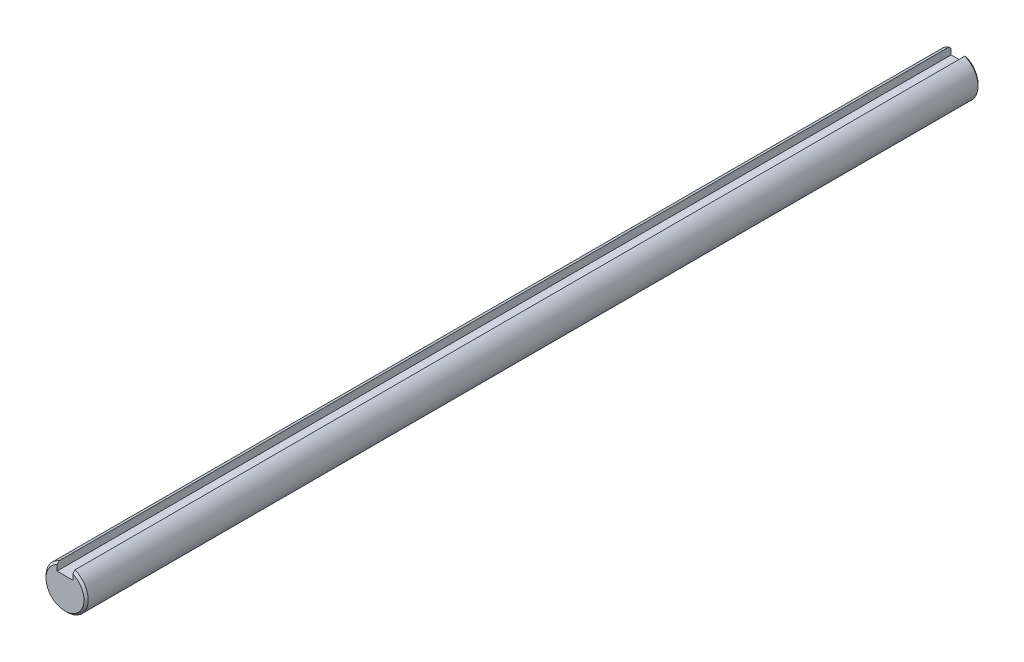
ISO-10303-21;
HEADER;
FILE_DESCRIPTION(('STEP AP214'),'2;1');
FILE_NAME('part.step','',(''),(''),'','','');
FILE_SCHEMA(('AUTOMOTIVE_DESIGN { 1 0 10303 214 1 1 1 1 }'));
ENDSEC;
DATA;
#1=APPLICATION_CONTEXT('core data for automotive mechanical design processes');
#2=APPLICATION_PROTOCOL_DEFINITION('international standard','automotive_design',2000,#1);
#3=PRODUCT_CONTEXT('',#1,'mechanical');
#4=PRODUCT('Part','Part','',(#3));
#5=PRODUCT_RELATED_PRODUCT_CATEGORY('part','',(#4));
#6=PRODUCT_DEFINITION_FORMATION('','',#4);
#7=PRODUCT_DEFINITION_CONTEXT('part definition',#1,'design');
#8=PRODUCT_DEFINITION('design','',#6,#7);
#9=PRODUCT_DEFINITION_SHAPE('','',#8);
#10=(LENGTH_UNIT() NAMED_UNIT(*) SI_UNIT(.MILLI.,.METRE.));
#11=(NAMED_UNIT(*) PLANE_ANGLE_UNIT() SI_UNIT($,.RADIAN.));
#12=(NAMED_UNIT(*) SI_UNIT($,.STERADIAN.) SOLID_ANGLE_UNIT());
#13=UNCERTAINTY_MEASURE_WITH_UNIT(LENGTH_MEASURE(1.E-05),#10,'distance_accuracy_value','');
#14=(GEOMETRIC_REPRESENTATION_CONTEXT(3) GLOBAL_UNCERTAINTY_ASSIGNED_CONTEXT((#13)) GLOBAL_UNIT_ASSIGNED_CONTEXT((#10,
#11,#12)) REPRESENTATION_CONTEXT('',''));
#15=CARTESIAN_POINT('',(0.,0.,0.));
#16=DIRECTION('',(0.,0.,1.));
#17=DIRECTION('',(1.,0.,0.));
#18=AXIS2_PLACEMENT_3D('',#15,#16,#17);
#19=CARTESIAN_POINT('',(0.,0.,67.31));
#20=DIRECTION('',(0.,0.,-1.));
#21=DIRECTION('',(-1.,0.,0.));
#22=AXIS2_PLACEMENT_3D('',#19,#20,#21);
#23=CYLINDRICAL_SURFACE('',#22,3.175);
#24=DIRECTION('',(0.,0.,-1.));
#25=VECTOR('',#24,1.);
#26=CARTESIAN_POINT('',(-1.190625,2.94330377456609,67.31));
#27=LINE('',#26,#25);
#28=CARTESIAN_POINT('',(-1.190625,2.94330377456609,66.9925));
#29=VERTEX_POINT('',#28);
#30=CARTESIAN_POINT('',(-1.190625,2.94330377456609,-66.9924999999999));
#31=VERTEX_POINT('',#30);
#32=EDGE_CURVE('E132',#29,#31,#27,.T.);
#33=ORIENTED_EDGE('',*,*,#32,.T.);
#34=CARTESIAN_POINT('',(0.,0.,-66.9924999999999));
#35=DIRECTION('',(0.,0.,1.));
#36=DIRECTION('',(1.,0.,0.));
#37=AXIS2_PLACEMENT_3D('',#34,#35,#36);
#38=CIRCLE('',#37,3.175);
#39=CARTESIAN_POINT('',(1.190625,2.94330377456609,-66.9924999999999));
#40=VERTEX_POINT('',#39);
#41=EDGE_CURVE('E147',#31,#40,#38,.T.);
#42=ORIENTED_EDGE('',*,*,#41,.T.);
#43=DIRECTION('',(0.,0.,-1.));
#44=VECTOR('',#43,1.);
#45=CARTESIAN_POINT('',(1.190625,2.94330377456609,67.31));
#46=LINE('',#45,#44);
#47=CARTESIAN_POINT('',(1.190625,2.94330377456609,66.9925));
#48=VERTEX_POINT('',#47);
#49=EDGE_CURVE('E137',#40,#48,#46,.F.);
#50=ORIENTED_EDGE('',*,*,#49,.T.);
#51=CARTESIAN_POINT('',(0.,0.,66.9925));
#52=DIRECTION('',(0.,0.,1.));
#53=DIRECTION('',(1.,0.,0.));
#54=AXIS2_PLACEMENT_3D('',#51,#52,#53);
#55=CIRCLE('',#54,3.175);
#56=EDGE_CURVE('E144',#48,#29,#55,.F.);
#57=ORIENTED_EDGE('',*,*,#56,.T.);
#58=EDGE_LOOP('',(#33,#42,#50,#57));
#59=FACE_BOUND('',#58,.T.);
#60=ADVANCED_FACE('F43',(#59),#23,.T.);
#61=CARTESIAN_POINT('',(0.,0.,67.31));
#62=DIRECTION('',(0.,0.,1.));
#63=DIRECTION('',(1.,0.,0.));
#64=AXIS2_PLACEMENT_3D('',#61,#62,#63);
#65=PLANE('',#64);
#66=DIRECTION('',(0.,-1.,0.));
#67=VECTOR('',#66,1.);
#68=CARTESIAN_POINT('',(-1.190625,3.175,67.31));
#69=LINE('',#68,#67);
#70=CARTESIAN_POINT('',(-1.190625,2.59763707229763,67.31));
#71=VERTEX_POINT('',#70);
#72=CARTESIAN_POINT('',(-1.190625,1.75267877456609,67.31));
#73=VERTEX_POINT('',#72);
#74=EDGE_CURVE('E98',#71,#73,#69,.T.);
#75=ORIENTED_EDGE('',*,*,#74,.F.);
#76=CARTESIAN_POINT('',(0.,0.,67.31));
#77=DIRECTION('',(0.,0.,1.));
#78=DIRECTION('',(1.,0.,0.));
#79=AXIS2_PLACEMENT_3D('',#76,#77,#78);
#80=CIRCLE('',#79,2.8575);
#81=CARTESIAN_POINT('',(1.190625,2.59763707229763,67.31));
#82=VERTEX_POINT('',#81);
#83=EDGE_CURVE('E11',#71,#82,#80,.T.);
#84=ORIENTED_EDGE('',*,*,#83,.T.);
#85=DIRECTION('',(0.,1.,0.));
#86=VECTOR('',#85,1.);
#87=CARTESIAN_POINT('',(1.190625,3.175,67.31));
#88=LINE('',#87,#86);
#89=CARTESIAN_POINT('',(1.190625,1.75267877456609,67.31));
#90=VERTEX_POINT('',#89);
#91=EDGE_CURVE('E121',#90,#82,#88,.T.);
#92=ORIENTED_EDGE('',*,*,#91,.F.);
#93=DIRECTION('',(1.,0.,0.));
#94=VECTOR('',#93,1.);
#95=CARTESIAN_POINT('',(-1.190625,1.75267877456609,67.31));
#96=LINE('',#95,#94);
#97=EDGE_CURVE('E106',#73,#90,#96,.T.);
#98=ORIENTED_EDGE('',*,*,#97,.F.);
#99=EDGE_LOOP('',(#75,#84,#92,#98));
#100=FACE_BOUND('',#99,.T.);
#101=ADVANCED_FACE('F119',(#100),#65,.T.);
#102=CARTESIAN_POINT('',(0.,0.,-67.31));
#103=DIRECTION('',(0.,0.,1.));
#104=DIRECTION('',(1.,0.,0.));
#105=AXIS2_PLACEMENT_3D('',#102,#103,#104);
#106=PLANE('',#105);
#107=DIRECTION('',(0.,1.,0.));
#108=VECTOR('',#107,1.);
#109=CARTESIAN_POINT('',(1.190625,3.175,-67.31));
#110=LINE('',#109,#108);
#111=CARTESIAN_POINT('',(1.190625,1.75267877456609,-67.31));
#112=VERTEX_POINT('',#111);
#113=CARTESIAN_POINT('',(1.190625,2.5976370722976,-67.31));
#114=VERTEX_POINT('',#113);
#115=EDGE_CURVE('E117',#112,#114,#110,.T.);
#116=ORIENTED_EDGE('',*,*,#115,.T.);
#117=CARTESIAN_POINT('',(0.,0.,-67.31));
#118=DIRECTION('',(0.,0.,1.));
#119=DIRECTION('',(1.,0.,0.));
#120=AXIS2_PLACEMENT_3D('',#117,#118,#119);
#121=CIRCLE('',#120,2.85749999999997);
#122=CARTESIAN_POINT('',(-1.190625,2.5976370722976,-67.31));
#123=VERTEX_POINT('',#122);
#124=EDGE_CURVE('E68',#114,#123,#121,.F.);
#125=ORIENTED_EDGE('',*,*,#124,.T.);
#126=DIRECTION('',(0.,-1.,0.));
#127=VECTOR('',#126,1.);
#128=CARTESIAN_POINT('',(-1.190625,0.,-67.31));
#129=LINE('',#128,#127);
#130=CARTESIAN_POINT('',(-1.190625,1.75267877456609,-67.31));
#131=VERTEX_POINT('',#130);
#132=EDGE_CURVE('E141',#123,#131,#129,.T.);
#133=ORIENTED_EDGE('',*,*,#132,.T.);
#134=DIRECTION('',(1.,0.,0.));
#135=VECTOR('',#134,1.);
#136=CARTESIAN_POINT('',(-1.190625,1.75267877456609,-67.31));
#137=LINE('',#136,#135);
#138=EDGE_CURVE('E114',#131,#112,#137,.T.);
#139=ORIENTED_EDGE('',*,*,#138,.T.);
#140=EDGE_LOOP('',(#116,#125,#133,#139));
#141=FACE_BOUND('',#140,.T.);
#142=ADVANCED_FACE('F169',(#141),#106,.F.);
#143=CARTESIAN_POINT('',(1.190625,3.175,-67.31));
#144=DIRECTION('',(1.,0.,0.));
#145=DIRECTION('',(0.,0.,-1.));
#146=AXIS2_PLACEMENT_3D('',#143,#144,#145);
#147=PLANE('',#146);
#148=ORIENTED_EDGE('',*,*,#49,.F.);
#149=CARTESIAN_POINT('',(1.190625,2.94330377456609,-66.9924999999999));
#150=CARTESIAN_POINT('',(1.190625,2.88594978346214,-67.0456965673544));
#151=CARTESIAN_POINT('',(1.190625,2.82846723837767,-67.0987531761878));
#152=CARTESIAN_POINT('',(1.190625,2.71324500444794,-67.2045865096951));
#153=CARTESIAN_POINT('',(1.190625,2.65550531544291,-67.2573632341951));
#154=CARTESIAN_POINT('',(1.190625,2.5976370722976,-67.31));
#155=B_SPLINE_CURVE_WITH_KNOTS('',3,(#149,#150,#151,#152,#153,#154),.UNSPECIFIED.,.F.,.F.,(4,2,
4),(0.,0.234676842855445,0.469353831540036),.UNSPECIFIED.);
#156=EDGE_CURVE('E159',#40,#114,#155,.T.);
#157=ORIENTED_EDGE('',*,*,#156,.T.);
#158=ORIENTED_EDGE('',*,*,#115,.F.);
#159=DIRECTION('',(0.,0.,1.));
#160=VECTOR('',#159,1.);
#161=CARTESIAN_POINT('',(1.190625,1.75267877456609,-67.31));
#162=LINE('',#161,#160);
#163=EDGE_CURVE('E116',#112,#90,#162,.T.);
#164=ORIENTED_EDGE('',*,*,#163,.T.);
#165=ORIENTED_EDGE('',*,*,#91,.T.);
#166=CARTESIAN_POINT('',(1.190625,2.59763707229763,67.31));
#167=CARTESIAN_POINT('',(1.190625,2.65550531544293,67.2573632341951));
#168=CARTESIAN_POINT('',(1.190625,2.71324500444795,67.2045865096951));
#169=CARTESIAN_POINT('',(1.190625,2.82846723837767,67.0987531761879));
#170=CARTESIAN_POINT('',(1.190625,2.88594978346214,67.0456965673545));
#171=CARTESIAN_POINT('',(1.190625,2.94330377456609,66.9925));
#172=B_SPLINE_CURVE_WITH_KNOTS('',3,(#166,#167,#168,#169,#170,#171),.UNSPECIFIED.,.F.,.F.,(4,2,
4),(0.,0.234676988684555,0.469353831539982),.UNSPECIFIED.);
#173=EDGE_CURVE('E151',#82,#48,#172,.T.);
#174=ORIENTED_EDGE('',*,*,#173,.T.);
#175=EDGE_LOOP('',(#148,#157,#158,#164,#165,#174));
#176=FACE_BOUND('',#175,.T.);
#177=ADVANCED_FACE('F165',(#176),#147,.F.);
#178=CARTESIAN_POINT('',(-1.190625,3.175,-67.31));
#179=DIRECTION('',(-1.,0.,0.));
#180=DIRECTION('',(0.,-1.,0.));
#181=AXIS2_PLACEMENT_3D('',#178,#179,#180);
#182=PLANE('',#181);
#183=ORIENTED_EDGE('',*,*,#132,.F.);
#184=CARTESIAN_POINT('',(-1.190625,2.5976370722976,-67.31));
#185=CARTESIAN_POINT('',(-1.190625,2.65550531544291,-67.2573632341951));
#186=CARTESIAN_POINT('',(-1.190625,2.71324500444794,-67.2045865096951));
#187=CARTESIAN_POINT('',(-1.190625,2.82846723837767,-67.0987531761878));
#188=CARTESIAN_POINT('',(-1.190625,2.88594978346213,-67.0456965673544));
#189=CARTESIAN_POINT('',(-1.190625,2.94330377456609,-66.9924999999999));
#190=B_SPLINE_CURVE_WITH_KNOTS('',3,(#184,#185,#186,#187,#188,#189),.UNSPECIFIED.,.F.,.F.,(4,2,
4),(0.,0.23467698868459,0.469353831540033),.UNSPECIFIED.);
#191=EDGE_CURVE('E53',#123,#31,#190,.T.);
#192=ORIENTED_EDGE('',*,*,#191,.T.);
#193=ORIENTED_EDGE('',*,*,#32,.F.);
#194=CARTESIAN_POINT('',(-1.190625,2.94330377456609,66.9925));
#195=CARTESIAN_POINT('',(-1.190625,2.88594978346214,67.0456965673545));
#196=CARTESIAN_POINT('',(-1.190625,2.82846723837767,67.0987531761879));
#197=CARTESIAN_POINT('',(-1.190625,2.71324500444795,67.2045865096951));
#198=CARTESIAN_POINT('',(-1.190625,2.65550531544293,67.2573632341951));
#199=CARTESIAN_POINT('',(-1.190625,2.59763707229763,67.31));
#200=B_SPLINE_CURVE_WITH_KNOTS('',3,(#194,#195,#196,#197,#198,#199),.UNSPECIFIED.,.F.,.F.,(4,2,
4),(0.,0.234676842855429,0.469353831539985),.UNSPECIFIED.);
#201=EDGE_CURVE('E60',#29,#71,#200,.T.);
#202=ORIENTED_EDGE('',*,*,#201,.T.);
#203=ORIENTED_EDGE('',*,*,#74,.T.);
#204=DIRECTION('',(0.,0.,1.));
#205=VECTOR('',#204,1.);
#206=CARTESIAN_POINT('',(-1.190625,1.75267877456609,-67.31));
#207=LINE('',#206,#205);
#208=EDGE_CURVE('E101',#131,#73,#207,.T.);
#209=ORIENTED_EDGE('',*,*,#208,.F.);
#210=EDGE_LOOP('',(#183,#192,#193,#202,#203,#209));
#211=FACE_BOUND('',#210,.T.);
#212=ADVANCED_FACE('F100',(#211),#182,.F.);
#213=CARTESIAN_POINT('',(-1.190625,1.75267877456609,-67.31));
#214=DIRECTION('',(0.,-1.,0.));
#215=DIRECTION('',(0.,0.,-1.));
#216=AXIS2_PLACEMENT_3D('',#213,#214,#215);
#217=PLANE('',#216);
#218=ORIENTED_EDGE('',*,*,#163,.F.);
#219=ORIENTED_EDGE('',*,*,#138,.F.);
#220=ORIENTED_EDGE('',*,*,#208,.T.);
#221=ORIENTED_EDGE('',*,*,#97,.T.);
#222=EDGE_LOOP('',(#218,#219,#220,#221));
#223=FACE_BOUND('',#222,.T.);
#224=ADVANCED_FACE('F111',(#223),#217,.F.);
#225=CARTESIAN_POINT('',(0.,0.,-66.9924999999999));
#226=DIRECTION('',(0.,0.,1.));
#227=DIRECTION('',(1.,0.,0.));
#228=AXIS2_PLACEMENT_3D('',#225,#226,#227);
#229=CONICAL_SURFACE('',#228,3.175,0.785398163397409);
#230=ORIENTED_EDGE('',*,*,#191,.F.);
#231=ORIENTED_EDGE('',*,*,#124,.F.);
#232=ORIENTED_EDGE('',*,*,#156,.F.);
#233=ORIENTED_EDGE('',*,*,#41,.F.);
#234=EDGE_LOOP('',(#230,#231,#232,#233));
#235=FACE_BOUND('',#234,.T.);
#236=ADVANCED_FACE('F174',(#235),#229,.T.);
#237=CARTESIAN_POINT('',(0.,0.,67.31));
#238=DIRECTION('',(0.,0.,-1.));
#239=DIRECTION('',(-1.,0.,0.));
#240=AXIS2_PLACEMENT_3D('',#237,#238,#239);
#241=CONICAL_SURFACE('',#240,2.8575,0.785398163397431);
#242=ORIENTED_EDGE('',*,*,#201,.F.);
#243=ORIENTED_EDGE('',*,*,#56,.F.);
#244=ORIENTED_EDGE('',*,*,#173,.F.);
#245=ORIENTED_EDGE('',*,*,#83,.F.);
#246=EDGE_LOOP('',(#242,#243,#244,#245));
#247=FACE_BOUND('',#246,.T.);
#248=ADVANCED_FACE('F45',(#247),#241,.T.);
#249=CLOSED_SHELL('',(#60,#101,#142,#177,#212,#224,#236,#248));
#250=MANIFOLD_SOLID_BREP('B2',#249);
#251=ADVANCED_BREP_SHAPE_REPRESENTATION('',(#18,#250),#14);
#252=SHAPE_DEFINITION_REPRESENTATION(#9,#251);
ENDSEC;
END-ISO-10303-21;
